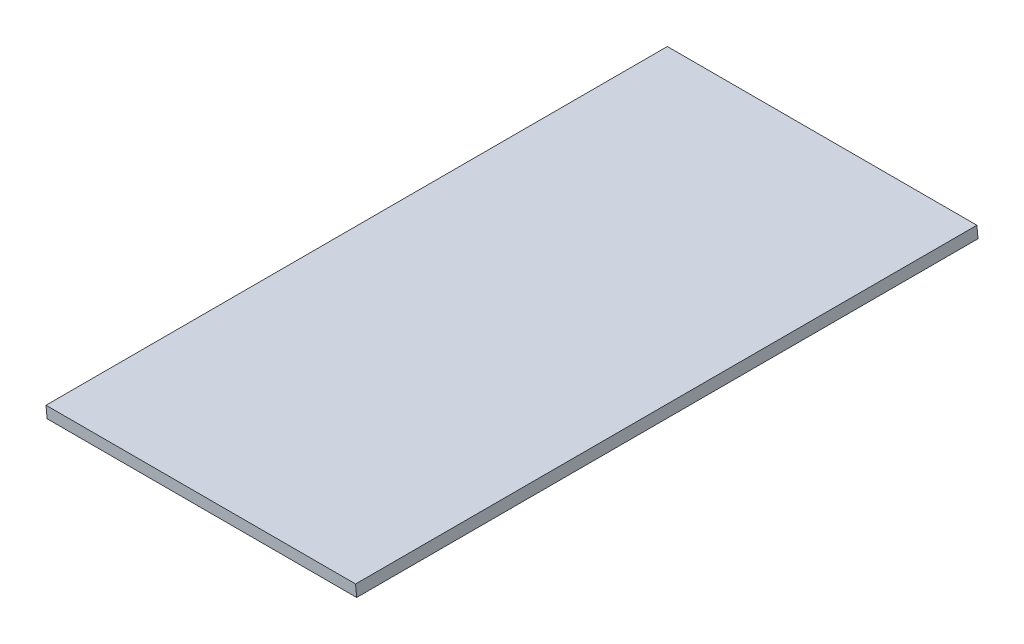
from build123d import *

# Parameters (mm, degrees)
RESSALTO_EXTRUS_O1_DEPTH = 1000


with BuildPart() as part:
    # Esbo_o3 → Ressalto-extrus_o1 (new body)
    with BuildSketch(Plane.XY):
        Polygon((-250, 9), (248.219224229, 9), (250, -9), (-248.219224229, -9), align=None)
    extrude(amount=RESSALTO_EXTRUS_O1_DEPTH)


solid = part.part
